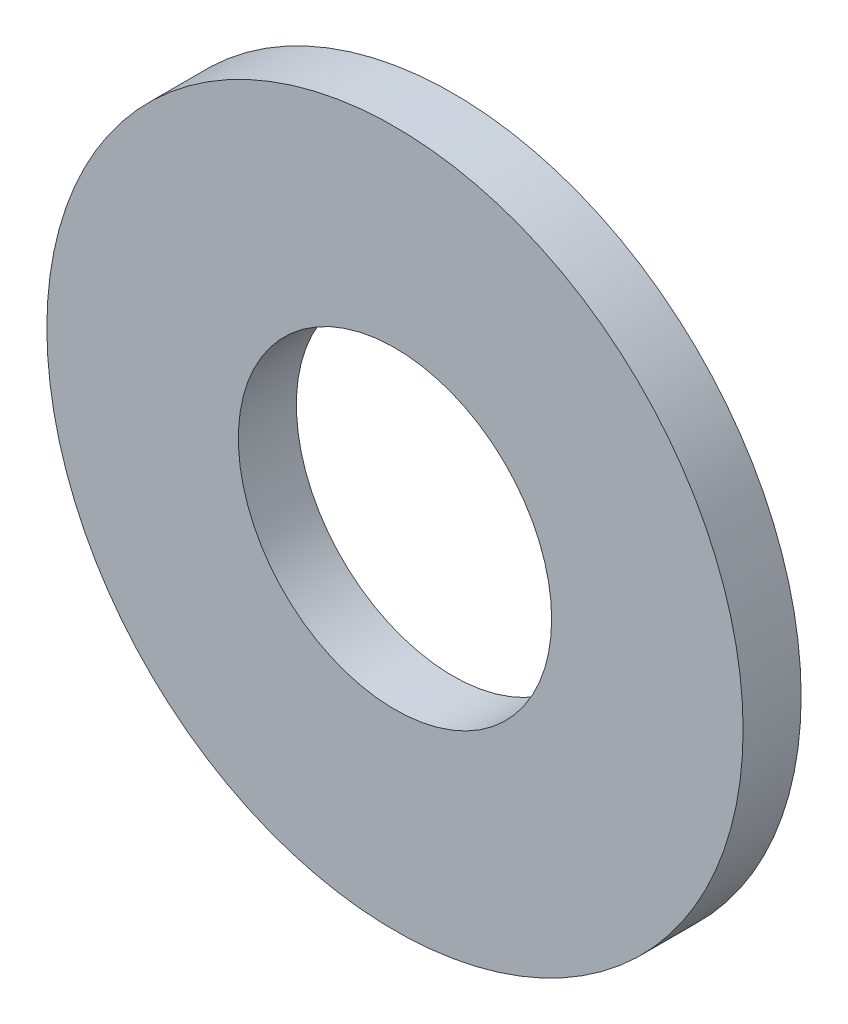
from build123d import *

# Parameters (mm, degrees)
SKETCH1_R          = 3
SKETCH1_R_2        = 1.35
BASE_EXTRUDE_DEPTH = 0.5


with BuildPart() as part:
    # Sketch1 → Base-Extrude (new body)
    with BuildSketch(Plane.XY):
        Circle(SKETCH1_R)
        Circle(SKETCH1_R_2, mode=Mode.SUBTRACT)
    extrude(amount=-BASE_EXTRUDE_DEPTH)


solid = part.part
